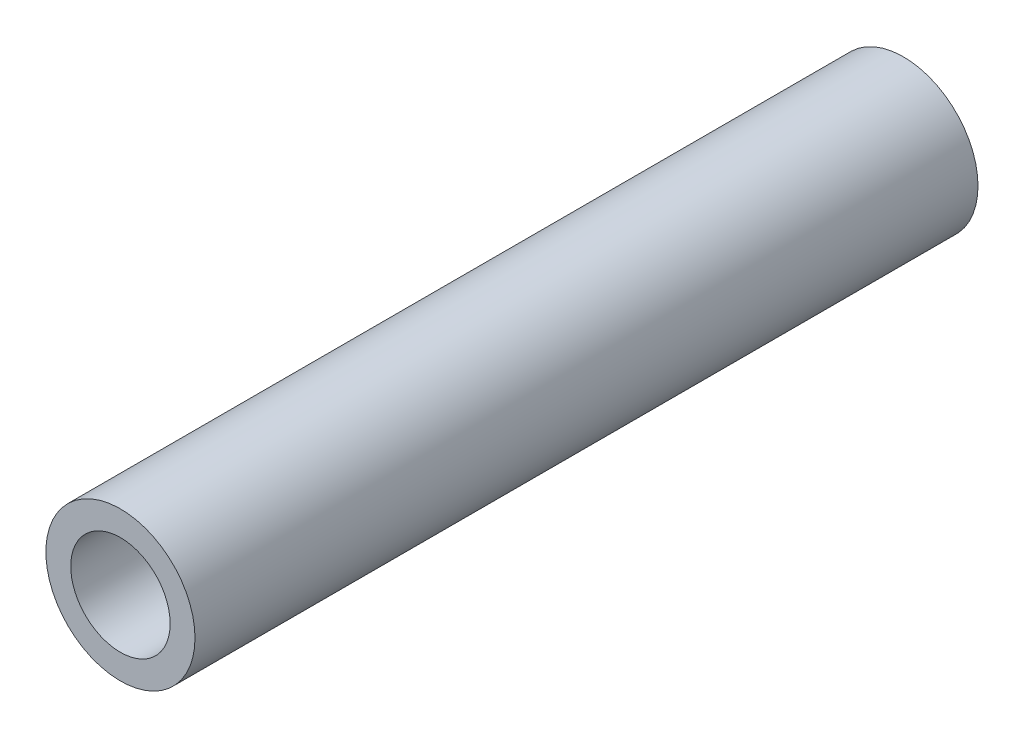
from build123d import *

# Parameters (mm, degrees)
ESQUISSE1_R      = 3
ESQUISSE1_R_2    = 2
EXTRUSION1_DEPTH = 31.5


with BuildPart() as part:
    # Esquisse1 → Extrusion1 (new body)
    with BuildSketch(Plane.XY):
        Circle(ESQUISSE1_R)
        Circle(ESQUISSE1_R_2, mode=Mode.SUBTRACT)
    extrude(amount=EXTRUSION1_DEPTH)


solid = part.part
